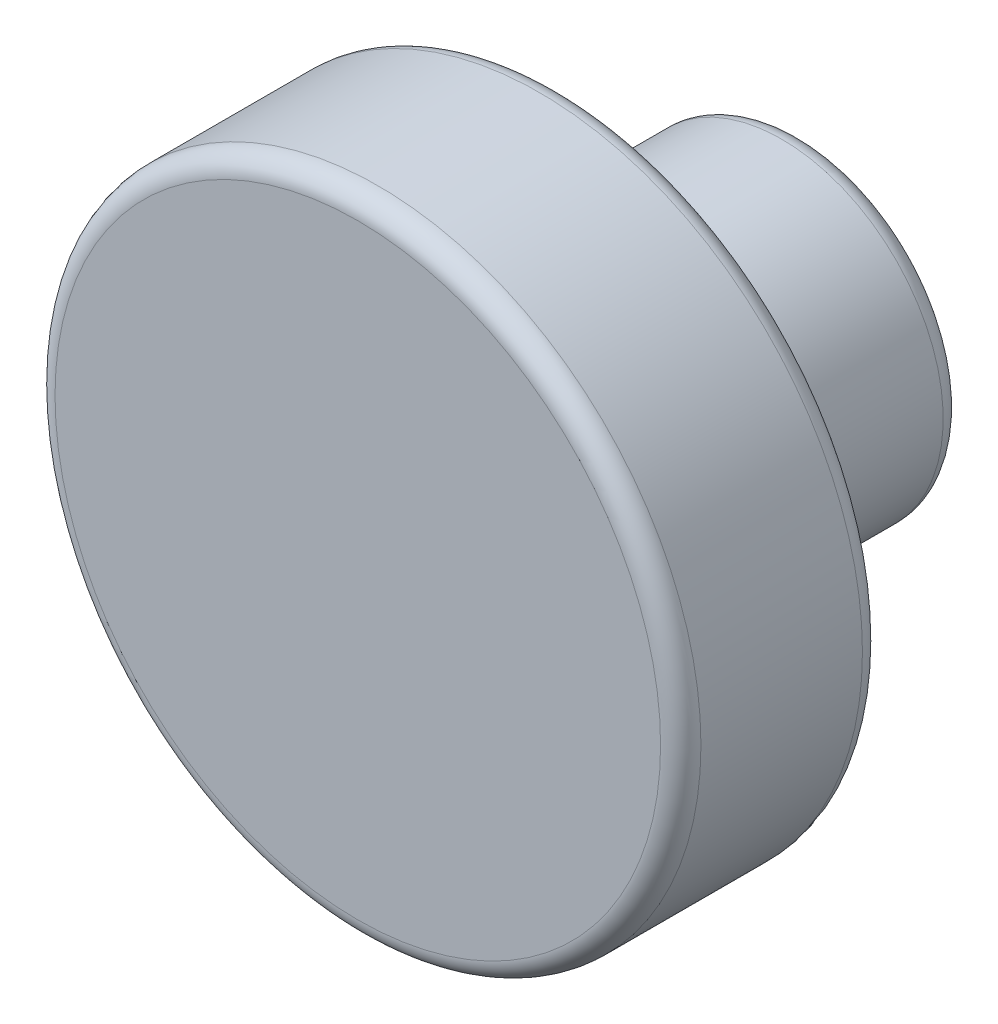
ISO-10303-21;
HEADER;
FILE_DESCRIPTION(('STEP AP214'),'2;1');
FILE_NAME('part.step','',(''),(''),'','','');
FILE_SCHEMA(('AUTOMOTIVE_DESIGN { 1 0 10303 214 1 1 1 1 }'));
ENDSEC;
DATA;
#1=APPLICATION_CONTEXT('core data for automotive mechanical design processes');
#2=APPLICATION_PROTOCOL_DEFINITION('international standard','automotive_design',2000,#1);
#3=PRODUCT_CONTEXT('',#1,'mechanical');
#4=PRODUCT('Part','Part','',(#3));
#5=PRODUCT_RELATED_PRODUCT_CATEGORY('part','',(#4));
#6=PRODUCT_DEFINITION_FORMATION('','',#4);
#7=PRODUCT_DEFINITION_CONTEXT('part definition',#1,'design');
#8=PRODUCT_DEFINITION('design','',#6,#7);
#9=PRODUCT_DEFINITION_SHAPE('','',#8);
#10=(LENGTH_UNIT() NAMED_UNIT(*) SI_UNIT(.MILLI.,.METRE.));
#11=(NAMED_UNIT(*) PLANE_ANGLE_UNIT() SI_UNIT($,.RADIAN.));
#12=(NAMED_UNIT(*) SI_UNIT($,.STERADIAN.) SOLID_ANGLE_UNIT());
#13=UNCERTAINTY_MEASURE_WITH_UNIT(LENGTH_MEASURE(1.E-05),#10,'distance_accuracy_value','');
#14=(GEOMETRIC_REPRESENTATION_CONTEXT(3) GLOBAL_UNCERTAINTY_ASSIGNED_CONTEXT((#13)) GLOBAL_UNIT_ASSIGNED_CONTEXT((#10,
#11,#12)) REPRESENTATION_CONTEXT('',''));
#15=CARTESIAN_POINT('',(0.,0.,0.));
#16=DIRECTION('',(0.,0.,1.));
#17=DIRECTION('',(1.,0.,0.));
#18=AXIS2_PLACEMENT_3D('',#15,#16,#17);
#19=CARTESIAN_POINT('',(0.,15.,22.));
#20=DIRECTION('',(0.,0.,-1.));
#21=DIRECTION('',(1.,0.,0.));
#22=AXIS2_PLACEMENT_3D('',#19,#20,#21);
#23=PLANE('',#22);
#24=CARTESIAN_POINT('',(0.,0.,22.));
#25=DIRECTION('',(0.,0.,1.));
#26=DIRECTION('',(-1.,0.,0.));
#27=AXIS2_PLACEMENT_3D('',#24,#25,#26);
#28=CIRCLE('',#27,15.);
#29=CARTESIAN_POINT('',(-15.,0.,22.));
#30=VERTEX_POINT('',#29);
#31=EDGE_CURVE('E8',#30,#30,#28,.T.);
#32=ORIENTED_EDGE('',*,*,#31,.T.);
#33=EDGE_LOOP('',(#32));
#34=FACE_BOUND('',#33,.T.);
#35=ADVANCED_FACE('F12',(#34),#23,.F.);
#36=CARTESIAN_POINT('',(0.,0.,21.));
#37=DIRECTION('',(0.,0.,1.));
#38=DIRECTION('',(-1.,0.,0.));
#39=AXIS2_PLACEMENT_3D('',#36,#37,#38);
#40=TOROIDAL_SURFACE('',#39,15.,1.);
#41=CARTESIAN_POINT('',(0.,0.,21.));
#42=DIRECTION('',(0.,0.,1.));
#43=DIRECTION('',(-1.,0.,0.));
#44=AXIS2_PLACEMENT_3D('',#41,#42,#43);
#45=CIRCLE('',#44,16.);
#46=CARTESIAN_POINT('',(-16.,0.,21.));
#47=VERTEX_POINT('',#46);
#48=EDGE_CURVE('E18',#47,#47,#45,.T.);
#49=ORIENTED_EDGE('',*,*,#48,.T.);
#50=EDGE_LOOP('',(#49));
#51=FACE_BOUND('',#50,.T.);
#52=ORIENTED_EDGE('',*,*,#31,.F.);
#53=EDGE_LOOP('',(#52));
#54=FACE_BOUND('',#53,.T.);
#55=ADVANCED_FACE('F63',(#51,#54),#40,.T.);
#56=CARTESIAN_POINT('',(0.,0.,24.5));
#57=DIRECTION('',(0.,0.,1.));
#58=DIRECTION('',(-1.,0.,0.));
#59=AXIS2_PLACEMENT_3D('',#56,#57,#58);
#60=CYLINDRICAL_SURFACE('',#59,16.);
#61=CARTESIAN_POINT('',(0.,0.,13.));
#62=DIRECTION('',(0.,0.,1.));
#63=DIRECTION('',(-1.,0.,0.));
#64=AXIS2_PLACEMENT_3D('',#61,#62,#63);
#65=CIRCLE('',#64,16.);
#66=CARTESIAN_POINT('',(-16.,0.,13.));
#67=VERTEX_POINT('',#66);
#68=EDGE_CURVE('E22',#67,#67,#65,.T.);
#69=ORIENTED_EDGE('',*,*,#68,.T.);
#70=EDGE_LOOP('',(#69));
#71=FACE_BOUND('',#70,.T.);
#72=ORIENTED_EDGE('',*,*,#48,.F.);
#73=EDGE_LOOP('',(#72));
#74=FACE_BOUND('',#73,.T.);
#75=ADVANCED_FACE('F67',(#71,#74),#60,.T.);
#76=CARTESIAN_POINT('',(0.,0.,13.));
#77=DIRECTION('',(0.,0.,1.));
#78=DIRECTION('',(-1.,0.,0.));
#79=AXIS2_PLACEMENT_3D('',#76,#77,#78);
#80=TOROIDAL_SURFACE('',#79,15.,1.);
#81=CARTESIAN_POINT('',(0.,0.,12.));
#82=DIRECTION('',(0.,0.,1.));
#83=DIRECTION('',(-1.,0.,0.));
#84=AXIS2_PLACEMENT_3D('',#81,#82,#83);
#85=CIRCLE('',#84,15.);
#86=CARTESIAN_POINT('',(-15.,0.,12.));
#87=VERTEX_POINT('',#86);
#88=EDGE_CURVE('E26',#87,#87,#85,.T.);
#89=ORIENTED_EDGE('',*,*,#88,.T.);
#90=EDGE_LOOP('',(#89));
#91=FACE_BOUND('',#90,.T.);
#92=ORIENTED_EDGE('',*,*,#68,.F.);
#93=EDGE_LOOP('',(#92));
#94=FACE_BOUND('',#93,.T.);
#95=ADVANCED_FACE('F71',(#91,#94),#80,.T.);
#96=CARTESIAN_POINT('',(0.,15.,12.));
#97=DIRECTION('',(0.,0.,-1.));
#98=DIRECTION('',(1.,0.,0.));
#99=AXIS2_PLACEMENT_3D('',#96,#97,#98);
#100=PLANE('',#99);
#101=CARTESIAN_POINT('',(0.,0.,12.));
#102=DIRECTION('',(0.,0.,1.));
#103=DIRECTION('',(-1.,0.,0.));
#104=AXIS2_PLACEMENT_3D('',#101,#102,#103);
#105=CIRCLE('',#104,9.);
#106=CARTESIAN_POINT('',(-9.,0.,12.));
#107=VERTEX_POINT('',#106);
#108=EDGE_CURVE('E31',#107,#107,#105,.T.);
#109=ORIENTED_EDGE('',*,*,#108,.T.);
#110=EDGE_LOOP('',(#109));
#111=FACE_BOUND('',#110,.T.);
#112=ORIENTED_EDGE('',*,*,#88,.F.);
#113=EDGE_LOOP('',(#112));
#114=FACE_BOUND('',#113,.T.);
#115=ADVANCED_FACE('F78',(#111,#114),#100,.T.);
#116=CARTESIAN_POINT('',(0.,0.,11.));
#117=DIRECTION('',(0.,0.,1.));
#118=DIRECTION('',(-1.,0.,0.));
#119=AXIS2_PLACEMENT_3D('',#116,#117,#118);
#120=TOROIDAL_SURFACE('',#119,9.,1.);
#121=ORIENTED_EDGE('',*,*,#108,.F.);
#122=EDGE_LOOP('',(#121));
#123=FACE_BOUND('',#122,.T.);
#124=CARTESIAN_POINT('',(0.,0.,11.));
#125=DIRECTION('',(0.,0.,1.));
#126=DIRECTION('',(-1.,0.,0.));
#127=AXIS2_PLACEMENT_3D('',#124,#125,#126);
#128=CIRCLE('',#127,8.);
#129=CARTESIAN_POINT('',(-8.,0.,11.));
#130=VERTEX_POINT('',#129);
#131=EDGE_CURVE('E34',#130,#130,#128,.T.);
#132=ORIENTED_EDGE('',*,*,#131,.T.);
#133=EDGE_LOOP('',(#132));
#134=FACE_BOUND('',#133,.T.);
#135=ADVANCED_FACE('F82',(#123,#134),#120,.F.);
#136=CARTESIAN_POINT('',(0.,0.,24.5));
#137=DIRECTION('',(0.,0.,1.));
#138=DIRECTION('',(-1.,0.,0.));
#139=AXIS2_PLACEMENT_3D('',#136,#137,#138);
#140=CYLINDRICAL_SURFACE('',#139,8.);
#141=ORIENTED_EDGE('',*,*,#131,.F.);
#142=EDGE_LOOP('',(#141));
#143=FACE_BOUND('',#142,.T.);
#144=CARTESIAN_POINT('',(0.,0.,1.));
#145=DIRECTION('',(0.,0.,1.));
#146=DIRECTION('',(-1.,0.,0.));
#147=AXIS2_PLACEMENT_3D('',#144,#145,#146);
#148=CIRCLE('',#147,8.);
#149=CARTESIAN_POINT('',(-8.,0.,1.));
#150=VERTEX_POINT('',#149);
#151=EDGE_CURVE('E37',#150,#150,#148,.T.);
#152=ORIENTED_EDGE('',*,*,#151,.T.);
#153=EDGE_LOOP('',(#152));
#154=FACE_BOUND('',#153,.T.);
#155=ADVANCED_FACE('F86',(#143,#154),#140,.T.);
#156=CARTESIAN_POINT('',(0.,0.,1.));
#157=DIRECTION('',(0.,0.,1.));
#158=DIRECTION('',(-1.,0.,0.));
#159=AXIS2_PLACEMENT_3D('',#156,#157,#158);
#160=TOROIDAL_SURFACE('',#159,7.,1.);
#161=CARTESIAN_POINT('',(0.,0.,0.));
#162=DIRECTION('',(0.,0.,1.));
#163=DIRECTION('',(-1.,0.,0.));
#164=AXIS2_PLACEMENT_3D('',#161,#162,#163);
#165=CIRCLE('',#164,7.);
#166=CARTESIAN_POINT('',(-7.,0.,0.));
#167=VERTEX_POINT('',#166);
#168=EDGE_CURVE('E40',#167,#167,#165,.T.);
#169=ORIENTED_EDGE('',*,*,#168,.T.);
#170=EDGE_LOOP('',(#169));
#171=FACE_BOUND('',#170,.T.);
#172=ORIENTED_EDGE('',*,*,#151,.F.);
#173=EDGE_LOOP('',(#172));
#174=FACE_BOUND('',#173,.T.);
#175=ADVANCED_FACE('F90',(#171,#174),#160,.T.);
#176=CARTESIAN_POINT('',(0.,7.,0.));
#177=DIRECTION('',(0.,0.,-1.));
#178=DIRECTION('',(1.,0.,0.));
#179=AXIS2_PLACEMENT_3D('',#176,#177,#178);
#180=PLANE('',#179);
#181=CARTESIAN_POINT('',(0.,0.,0.));
#182=DIRECTION('',(0.,0.,1.));
#183=DIRECTION('',(-1.,0.,0.));
#184=AXIS2_PLACEMENT_3D('',#181,#182,#183);
#185=CIRCLE('',#184,2.5);
#186=CARTESIAN_POINT('',(-2.5,0.,0.));
#187=VERTEX_POINT('',#186);
#188=EDGE_CURVE('E43',#187,#187,#185,.T.);
#189=ORIENTED_EDGE('',*,*,#188,.T.);
#190=EDGE_LOOP('',(#189));
#191=FACE_BOUND('',#190,.T.);
#192=ORIENTED_EDGE('',*,*,#168,.F.);
#193=EDGE_LOOP('',(#192));
#194=FACE_BOUND('',#193,.T.);
#195=ADVANCED_FACE('F59',(#191,#194),#180,.T.);
#196=CARTESIAN_POINT('',(0.,0.,24.5));
#197=DIRECTION('',(0.,0.,1.));
#198=DIRECTION('',(-1.,0.,0.));
#199=AXIS2_PLACEMENT_3D('',#196,#197,#198);
#200=CYLINDRICAL_SURFACE('',#199,2.5);
#201=ORIENTED_EDGE('',*,*,#188,.F.);
#202=EDGE_LOOP('',(#201));
#203=FACE_BOUND('',#202,.T.);
#204=CARTESIAN_POINT('',(0.,0.,10.));
#205=DIRECTION('',(0.,0.,-1.));
#206=DIRECTION('',(-1.,0.,0.));
#207=AXIS2_PLACEMENT_3D('',#204,#205,#206);
#208=CIRCLE('',#207,2.5);
#209=CARTESIAN_POINT('',(-2.5,0.,10.));
#210=VERTEX_POINT('',#209);
#211=EDGE_CURVE('E46',#210,#210,#208,.F.);
#212=ORIENTED_EDGE('',*,*,#211,.T.);
#213=EDGE_LOOP('',(#212));
#214=FACE_BOUND('',#213,.T.);
#215=ADVANCED_FACE('F50',(#203,#214),#200,.F.);
#216=CARTESIAN_POINT('',(0.,0.,10.));
#217=DIRECTION('',(0.,0.,-1.));
#218=DIRECTION('',(-1.,0.,0.));
#219=AXIS2_PLACEMENT_3D('',#216,#217,#218);
#220=PLANE('',#219);
#221=ORIENTED_EDGE('',*,*,#211,.F.);
#222=EDGE_LOOP('',(#221));
#223=FACE_BOUND('',#222,.T.);
#224=ADVANCED_FACE('F52',(#223),#220,.T.);
#225=CLOSED_SHELL('',(#35,#55,#75,#95,#115,#135,#155,#175,#195,#215,#224));
#226=MANIFOLD_SOLID_BREP('B1',#225);
#227=ADVANCED_BREP_SHAPE_REPRESENTATION('',(#18,#226),#14);
#228=SHAPE_DEFINITION_REPRESENTATION(#9,#227);
ENDSEC;
END-ISO-10303-21;
